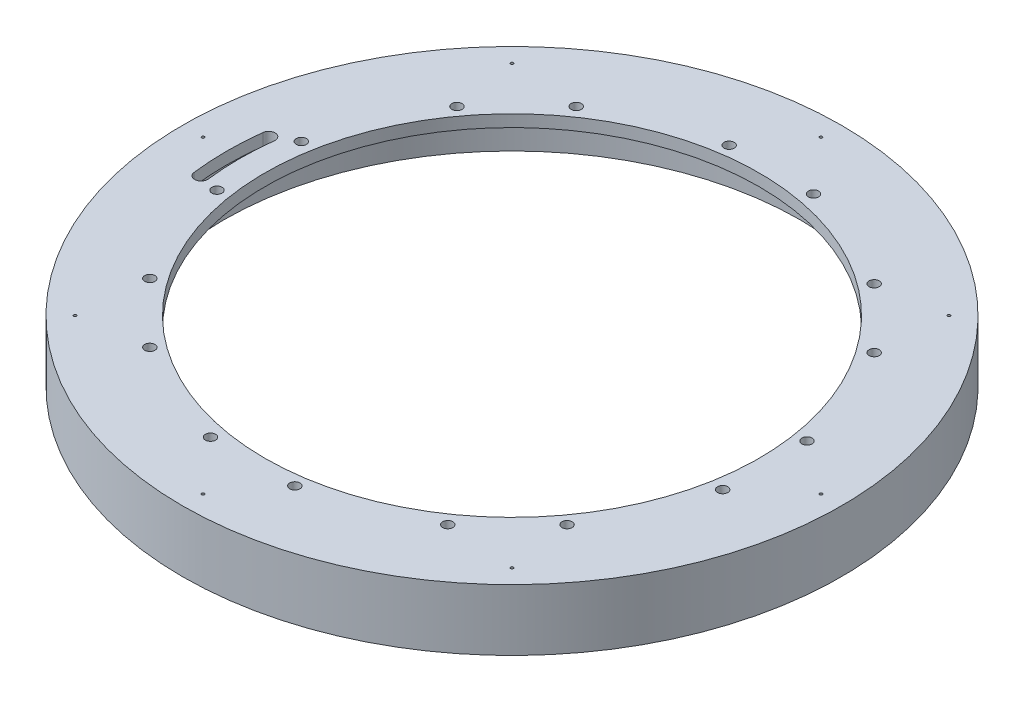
from build123d import *

# Parameters (mm, degrees)
SKETCH1_R                                   = 101.6
BOSS_EXTRUDE1_DEPTH                         = 18.923
SKETCH2_R                                   = 88.9
CUT_EXTRUDE1_DEPTH                          = 15.24
SKETCH3_R                                   = 76.2
CUT_EXTRUDE2_DEPTH                          = 145.924807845
CIRPATTERN1_COUNT                           = 8
TAPPED_HOLE_FOR_M3X0_5_HELICOIL1_AT_2_COUNT = 2
TAPPED_HOLE_FOR_M3X0_5_HELICOIL1_AT_2_PITCH = 26
CIRPATTERN2_COUNT                           = 8
CUT_EXTRUDE4_DEPTH                          = 145.924807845


with BuildPart() as part:
    # Sketch1 → Boss-Extrude1 (new body)
    with BuildSketch(Plane(origin=(0, 0, 0), x_dir=(1, 0, 0), z_dir=(0, 1, 0))):
        with Locations(Location((0, 0, 0), (0, 0, 270))):
            Circle(SKETCH1_R)
    extrude(amount=BOSS_EXTRUDE1_DEPTH)

    # Sketch2 → Cut-Extrude1 (cut)
    with BuildSketch(Plane(origin=(0, 0, 0), x_dir=(-1, 0, 0), z_dir=(0, -1, 0))):
        with Locations(Location((0, 0, 0), (0, 0, 90))):
            Circle(SKETCH2_R)
    extrude(amount=-CUT_EXTRUDE1_DEPTH, mode=Mode.SUBTRACT)

    # Sketch3 → Cut-Extrude2 (cut, through all)
    with BuildSketch(Plane(origin=(0, 18.923, 0), x_dir=(1, 0, 0), z_dir=(0, 1, 0))):
        with Locations(Location((0, 0, 0), (0, 0, 270))):
            Circle(SKETCH3_R)
    extrude(amount=-CUT_EXTRUDE2_DEPTH, mode=Mode.SUBTRACT)

    # Sketch5 → Tapped Hole for 1_4-20 Helicoil1 (revolve, cut)
    with BuildSketch(Plane(origin=(0, 0, 95.25), x_dir=(0, 0, -1), z_dir=(1, 0, 0))):
        Polygon((0, 0), (0, 19.174827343), (3.3782, 17.145), (3.3782, 0), align=None)
    tapped_hole_for_1_4_20_helicoil1 = revolve(axis=Axis((0, -6.35, 95.25), (0, 1, 0)), mode=Mode.SUBTRACT)

    # CirPattern1: Tapped Hole for 1_4-20 Helicoil1 ×8 about axis
    cirpattern1_axis = Axis((0, 0, 0), (0, 1, 0))
    for i in range(1, CIRPATTERN1_COUNT):
        add(tapped_hole_for_1_4_20_helicoil1.rotate(cirpattern1_axis, i * 360 / CIRPATTERN1_COUNT), mode=Mode.SUBTRACT)

    # Sketch8 → Tapped Hole for M3x0.5 Helicoil1 (revolve, cut)
    with BuildSketch(Plane(origin=(-12, 18.923, -78.95), x_dir=(0, 0, 1), z_dir=(1, 0, 0))):
        Polygon((0, 0), (0, 11.596355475), (1.575, 10.65), (1.575, 0), align=None)
    tapped_hole_for_m3x0_5_helicoil1 = revolve(axis=Axis((-12, 25.273, -78.95), (0, -1, 0)), mode=Mode.SUBTRACT)

    # Tapped Hole for M3x0.5 Helicoil1 at 2: Tapped Hole for M3x0.5 Helicoil1 ×2
    with Locations(*[(i * TAPPED_HOLE_FOR_M3X0_5_HELICOIL1_AT_2_PITCH, 0, 0) for i in range(1, TAPPED_HOLE_FOR_M3X0_5_HELICOIL1_AT_2_COUNT)]):
        add(tapped_hole_for_m3x0_5_helicoil1, mode=Mode.SUBTRACT)

    # CirPattern2: Tapped Hole for M3x0.5 Helicoil1 ×8 about axis
    cirpattern2_axis = Axis((0, 0, 0), (0, 1, 0))
    for i in range(1, CIRPATTERN2_COUNT):
        add(tapped_hole_for_m3x0_5_helicoil1.rotate(cirpattern2_axis, i * 360 / CIRPATTERN2_COUNT), mode=Mode.SUBTRACT)

    # CirPattern2 copy 1 sketch → CirPattern2 copy 1 (revolve, cut)
    with BuildSketch(Plane(origin=(-45.926585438, 18.923, -65.725575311), x_dir=(0.7071067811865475, 0, 0.7071067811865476), z_dir=(0.7071067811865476, 0, -0.7071067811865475))):
        Polygon((0, 0), (0, 11.596355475), (1.575, 10.65), (1.575, 0), align=None)
    revolve(axis=Axis((-45.926585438, 25.273, -65.725575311), (0, -1, 0)), mode=Mode.SUBTRACT)

    # CirPattern2 copy 2 sketch → CirPattern2 copy 2 (revolve, cut)
    with BuildSketch(Plane(origin=(-78.95, 18.923, -14), x_dir=(1, 0, 0), z_dir=(0, 0, -1))):
        Polygon((0, 0), (0, 11.596355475), (1.575, 10.65), (1.575, 0), align=None)
    revolve(axis=Axis((-78.95, 25.273, -14), (0, -1, 0)), mode=Mode.SUBTRACT)

    # CirPattern2 copy 3 sketch → CirPattern2 copy 3 (revolve, cut)
    with BuildSketch(Plane(origin=(-65.725575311, 18.923, 45.926585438), x_dir=(0.7071067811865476, 0, -0.7071067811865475), z_dir=(-0.7071067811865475, 0, -0.7071067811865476))):
        Polygon((0, 0), (0, 11.596355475), (1.575, 10.65), (1.575, 0), align=None)
    revolve(axis=Axis((-65.725575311, 25.273, 45.926585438), (0, -1, 0)), mode=Mode.SUBTRACT)

    # CirPattern2 copy 4 sketch → CirPattern2 copy 4 (revolve, cut)
    with BuildSketch(Plane(origin=(-14, 18.923, 78.95), x_dir=(0, 0, -1), z_dir=(-1, 0, 0))):
        Polygon((0, 0), (0, 11.596355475), (1.575, 10.65), (1.575, 0), align=None)
    revolve(axis=Axis((-14, 25.273, 78.95), (0, -1, 0)), mode=Mode.SUBTRACT)

    # CirPattern2 copy 5 sketch → CirPattern2 copy 5 (revolve, cut)
    with BuildSketch(Plane(origin=(45.926585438, 18.923, 65.725575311), x_dir=(-0.7071067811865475, 0, -0.7071067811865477), z_dir=(-0.7071067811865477, 0, 0.7071067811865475))):
        Polygon((0, 0), (0, 11.596355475), (1.575, 10.65), (1.575, 0), align=None)
    revolve(axis=Axis((45.926585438, 25.273, 65.725575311), (0, -1, 0)), mode=Mode.SUBTRACT)

    # CirPattern2 copy 6 sketch → CirPattern2 copy 6 (revolve, cut)
    with BuildSketch(Plane(origin=(78.95, 18.923, 14), x_dir=(-1, 0, 0), z_dir=(0, 0, 1))):
        Polygon((0, 0), (0, 11.596355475), (1.575, 10.65), (1.575, 0), align=None)
    revolve(axis=Axis((78.95, 25.273, 14), (0, -1, 0)), mode=Mode.SUBTRACT)

    # CirPattern2 copy 7 sketch → CirPattern2 copy 7 (revolve, cut)
    with BuildSketch(Plane(origin=(65.725575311, 18.923, -45.926585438), x_dir=(-0.7071067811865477, 0, 0.7071067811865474), z_dir=(0.7071067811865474, 0, 0.7071067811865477))):
        Polygon((0, 0), (0, 11.596355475), (1.575, 10.65), (1.575, 0), align=None)
    revolve(axis=Axis((65.725575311, 25.273, -45.926585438), (0, -1, 0)), mode=Mode.SUBTRACT)

    # Sketch11 → Cut-Extrude4 (cut, through all)
    with BuildSketch(Plane(origin=(0, 18.923, 0), x_dir=(1, 0, 0), z_dir=(0, 1, 0))):
        with BuildLine():
            ThreePointArc((-87.267846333, 10.498843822), (-87.896958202, -0.165722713), (-87.227636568, -10.827841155))
            ThreePointArc((-87.227636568, -10.827841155), (-84.996494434, -12.566232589), (-83.258102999, -10.335090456))
            ThreePointArc((-83.258102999, -10.335090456), (-83.896965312, -0.158181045), (-83.296482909, 10.021065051))
            ThreePointArc((-83.296482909, 10.021065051), (-85.043275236, 12.245636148), (-87.267846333, 10.498843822))
        make_face()
    extrude(amount=-CUT_EXTRUDE4_DEPTH, mode=Mode.SUBTRACT)


solid = part.part
